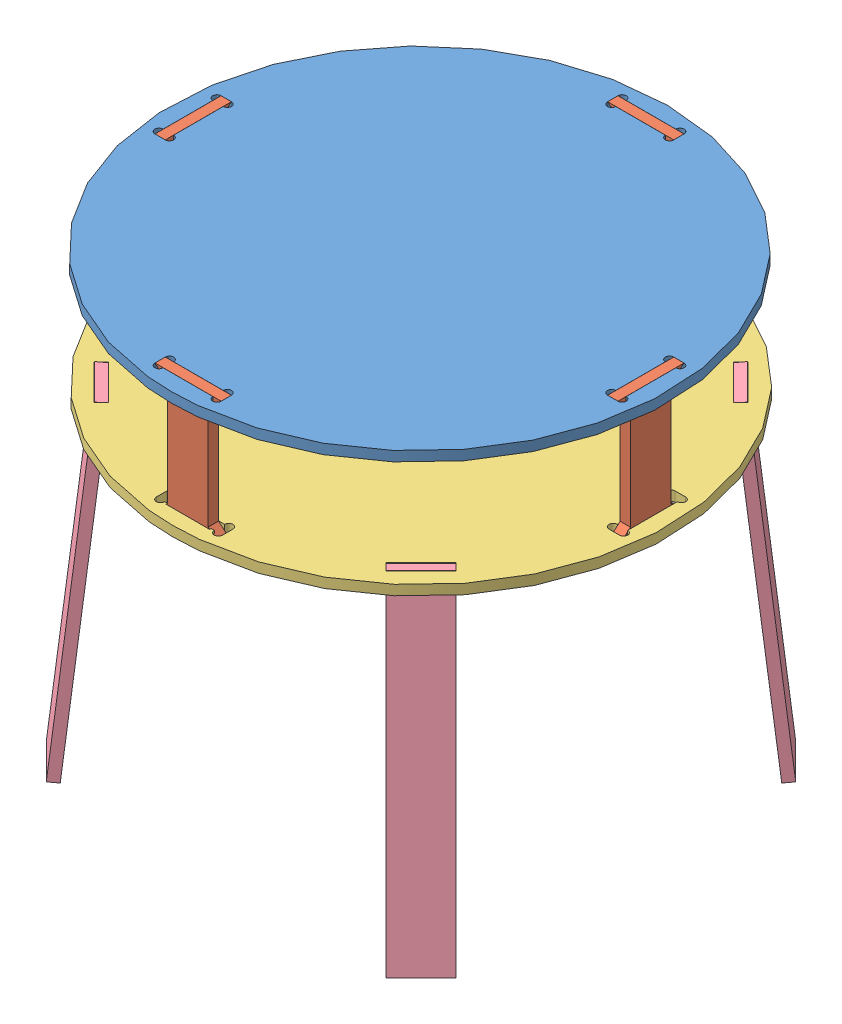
SolidWorks assembly Assem2.SLDASM, configuration Default (file format 10000). Lengths in mm.
Overall size (600.05 539.69 601.85).
10 component instances, 4 part files, 4 mates.
Components (placement in the parent):
- bottom-1: bottom.SLDPRT [Default] at (174.8177 340.8238 463.5824) size (600 12 600)
- lock-4: lock.SLDPRT [Default] at (175.0181 276.2238 183.6324) x (-1 0 0) z (0 1 0) size (80 12.5 153.2)
- lock-9: lock.SLDPRT [Default] at (-105.1323 276.2238 463.382) x (0 0 1) z (0 1 0) size (80 12.5 153.2)
- lock-10: lock.SLDPRT [Default] at (174.6173 276.2238 743.5324) x (1 0 0) z (0 1 0) size (80 12.5 153.2)
- lock-11: lock.SLDPRT [Default] at (454.7677 276.2238 463.7828) x (0 0 -1) z (0 1 0) size (80 12.5 153.2)
- top-1: top.SLDPRT [Default] at (174.7677 199.6238 461.7278) size (600 12 600)
- L1-1: L1.SLDPRT [Default] at (378.3936 12.0681 258.1019) x (0.707107 0 0.707107) z (-0.072761 0.994692 0.072761) size (60 12 400)
- L1-2: L1.SLDPRT [Default] at (-28.8582 12.0681 258.1019) x (0.707107 0 -0.707107) z (0.072761 0.994692 0.072761) size (60 12 400)
- L1-3: L1.SLDPRT [Default] at (-28.8582 12.0681 665.3537) x (-0.707107 0 -0.707107) z (0.072761 0.994692 -0.072761) size (60 12 400)
- L1-4: L1.SLDPRT [Default] at (378.3936 12.0681 665.3537) x (-0.707107 0 0.707107) z (-0.072761 0.994692 -0.072761) size (60 12 400)
Mates (geometry in assembly coordinates):
- Coincident11: coincident aligned: plane of bottom-1 through (174.8177 352.8238 463.5824) normal (0 1 0); line of lock-4 through (214.8181 352.8238 196.1324) axis (-1 0 0)
- Coincident18: coincident: moEndPointRef_w of bottom-1; moEndPointRef_w of lock-4
- Coincident19: coincident aligned: line of lock-9 through (-92.6323 199.6238 503.582) axis (0 0 -1); line of top-1 through (-92.6323 199.6238 491.7278) axis (0 0 -1)
- Coincident24: coincident anti-aligned: moEndPointRef_w of top-1; moEndPointRef_w of L1-1
